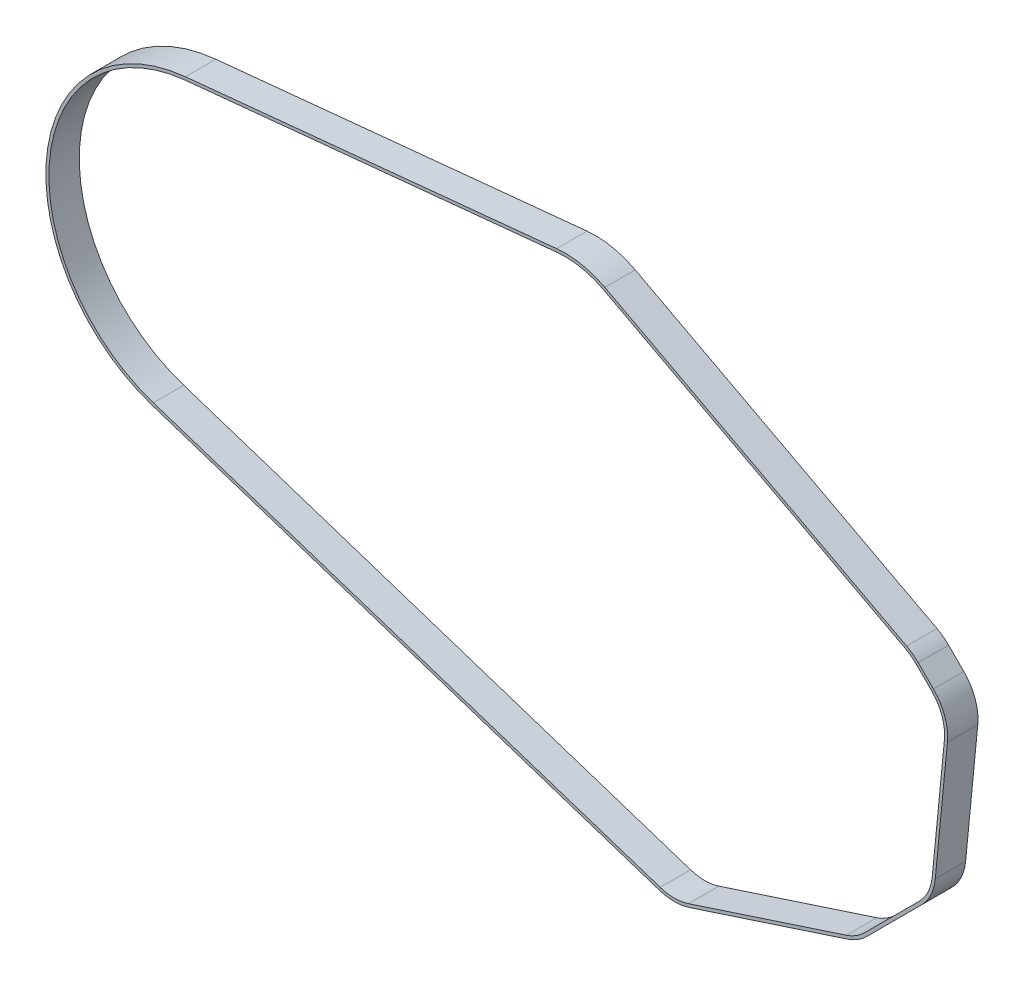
from build123d import *

# Parameters (mm, degrees)
EXTRUDE1_DEPTH = 10


with BuildPart() as part:
    # Sketch1 → Extrude1 (new body)
    with BuildSketch(Plane.XY):
        with BuildLine():
            Line((-5.027546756, 50.751588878), (117.239778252, 62.863617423))
            ThreePointArc((117.239778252, 62.863617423), (125.399068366, 62.474534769), (133.098849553, 59.747123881))
            Line((133.098849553, 59.747123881), (232.485056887, 7.141213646))
            ThreePointArc((232.485056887, 7.141213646), (234.505108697, 5.870621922), (236.313708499, 4.313708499))
            Line((236.313708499, 4.313708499), (241.313708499, -0.686291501))
            ThreePointArc((241.313708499, -0.686291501), (245.062219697, -6.602821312), (245.924394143, -13.553599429))
            Line((245.924394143, -13.553599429), (241.924394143, -54.553599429))
            ThreePointArc((241.924394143, -54.553599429), (240.466979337, -59.834216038), (237.313708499, -64.313708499))
            Line((237.313708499, -64.313708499), (219.313708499, -82.313708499))
            ThreePointArc((219.313708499, -82.313708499), (216.372326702, -84.634667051), (212.971821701, -86.207925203))
            Line((212.971821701, -86.207925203), (160.971821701, -103.207925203))
            ThreePointArc((160.971821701, -103.207925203), (155.992333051, -103.999998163), (151.013605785, -103.203153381))
            Line((151.013605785, -103.203153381), (-15.89413156, -48.460051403))
            ThreePointArc((-15.89413156, -48.460051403), (-50.696810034, 5.552787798), (-5.027546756, 50.751588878))
        make_face()
        with BuildLine():
            Line((-4.928967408, 49.756459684), (117.3383576, 61.868488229))
            ThreePointArc((117.3383576, 61.868488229), (125.206244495, 61.493301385), (132.631033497, 58.863298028))
            Line((132.631033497, 58.863298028), (232.017240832, 6.257387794))
            ThreePointArc((232.017240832, 6.257387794), (233.911039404, 5.066208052), (235.606601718, 3.606601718))
            Line((235.606601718, 3.606601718), (240.606601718, -1.393398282))
            ThreePointArc((240.606601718, -1.393398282), (244.120830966, -6.94014498), (244.929119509, -13.456499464))
            Line((244.929119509, -13.456499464), (240.929119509, -54.456499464))
            ThreePointArc((240.929119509, -54.456499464), (239.562793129, -59.407077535), (236.606601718, -63.606601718))
            Line((236.606601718, -63.606601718), (218.606601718, -81.606601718))
            ThreePointArc((218.606601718, -81.606601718), (215.849056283, -83.78250036), (212.661082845, -85.257429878))
            Line((212.661082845, -85.257429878), (160.661082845, -102.257429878))
            ThreePointArc((160.661082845, -102.257429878), (155.992812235, -102.999998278), (151.325255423, -102.252956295))
            Line((151.325255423, -102.252956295), (-15.582481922, -47.509854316))
            ThreePointArc((-15.582481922, -47.509854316), (-49.702754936, 5.443909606), (-4.928967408, 49.756459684))
        make_face(mode=Mode.SUBTRACT)
    extrude(amount=-EXTRUDE1_DEPTH)


solid = part.part
